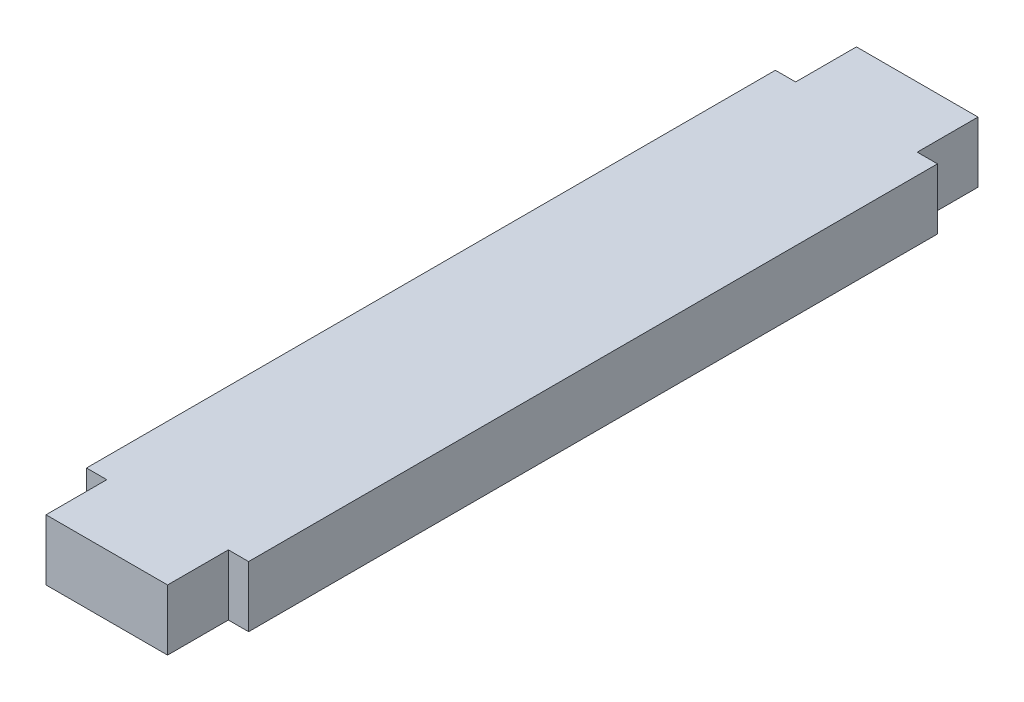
ISO-10303-21;
HEADER;
FILE_DESCRIPTION(('STEP AP214'),'2;1');
FILE_NAME('part.step','',(''),(''),'','','');
FILE_SCHEMA(('AUTOMOTIVE_DESIGN { 1 0 10303 214 1 1 1 1 }'));
ENDSEC;
DATA;
#1=APPLICATION_CONTEXT('core data for automotive mechanical design processes');
#2=APPLICATION_PROTOCOL_DEFINITION('international standard','automotive_design',2000,#1);
#3=PRODUCT_CONTEXT('',#1,'mechanical');
#4=PRODUCT('Part','Part','',(#3));
#5=PRODUCT_RELATED_PRODUCT_CATEGORY('part','',(#4));
#6=PRODUCT_DEFINITION_FORMATION('','',#4);
#7=PRODUCT_DEFINITION_CONTEXT('part definition',#1,'design');
#8=PRODUCT_DEFINITION('design','',#6,#7);
#9=PRODUCT_DEFINITION_SHAPE('','',#8);
#10=(LENGTH_UNIT() NAMED_UNIT(*) SI_UNIT(.MILLI.,.METRE.));
#11=(NAMED_UNIT(*) PLANE_ANGLE_UNIT() SI_UNIT($,.RADIAN.));
#12=(NAMED_UNIT(*) SI_UNIT($,.STERADIAN.) SOLID_ANGLE_UNIT());
#13=UNCERTAINTY_MEASURE_WITH_UNIT(LENGTH_MEASURE(1.E-05),#10,'distance_accuracy_value','');
#14=(GEOMETRIC_REPRESENTATION_CONTEXT(3) GLOBAL_UNCERTAINTY_ASSIGNED_CONTEXT((#13)) GLOBAL_UNIT_ASSIGNED_CONTEXT((#10,
#11,#12)) REPRESENTATION_CONTEXT('',''));
#15=CARTESIAN_POINT('',(0.,0.,0.));
#16=DIRECTION('',(0.,0.,1.));
#17=DIRECTION('',(1.,0.,0.));
#18=AXIS2_PLACEMENT_3D('',#15,#16,#17);
#19=CARTESIAN_POINT('',(0.,15.,0.));
#20=DIRECTION('',(1.,0.,0.));
#21=DIRECTION('',(0.,0.,-1.));
#22=AXIS2_PLACEMENT_3D('',#19,#20,#21);
#23=PLANE('',#22);
#24=DIRECTION('',(0.,0.,1.));
#25=VECTOR('',#24,1.);
#26=CARTESIAN_POINT('',(0.,0.,0.));
#27=LINE('',#26,#25);
#28=CARTESIAN_POINT('',(0.,0.,-15.));
#29=VERTEX_POINT('',#28);
#30=CARTESIAN_POINT('',(0.,0.,0.));
#31=VERTEX_POINT('',#30);
#32=EDGE_CURVE('E168',#29,#31,#27,.T.);
#33=ORIENTED_EDGE('',*,*,#32,.T.);
#34=DIRECTION('',(0.,-1.,0.));
#35=VECTOR('',#34,1.);
#36=CARTESIAN_POINT('',(0.,15.,0.));
#37=LINE('',#36,#35);
#38=CARTESIAN_POINT('',(0.,15.,0.));
#39=VERTEX_POINT('',#38);
#40=EDGE_CURVE('E11',#39,#31,#37,.T.);
#41=ORIENTED_EDGE('',*,*,#40,.F.);
#42=DIRECTION('',(0.,0.,1.));
#43=VECTOR('',#42,1.);
#44=CARTESIAN_POINT('',(0.,15.,0.));
#45=LINE('',#44,#43);
#46=CARTESIAN_POINT('',(0.,15.,-15.));
#47=VERTEX_POINT('',#46);
#48=EDGE_CURVE('E202',#47,#39,#45,.T.);
#49=ORIENTED_EDGE('',*,*,#48,.F.);
#50=DIRECTION('',(0.,-1.,0.));
#51=VECTOR('',#50,1.);
#52=CARTESIAN_POINT('',(0.,15.,-15.));
#53=LINE('',#52,#51);
#54=EDGE_CURVE('E164',#47,#29,#53,.T.);
#55=ORIENTED_EDGE('',*,*,#54,.T.);
#56=EDGE_LOOP('',(#33,#41,#49,#55));
#57=FACE_BOUND('',#56,.T.);
#58=ADVANCED_FACE('F43',(#57),#23,.F.);
#59=CARTESIAN_POINT('',(0.,15.,0.));
#60=DIRECTION('',(0.,0.,-1.));
#61=DIRECTION('',(-1.,0.,0.));
#62=AXIS2_PLACEMENT_3D('',#59,#60,#61);
#63=PLANE('',#62);
#64=DIRECTION('',(1.,0.,0.));
#65=VECTOR('',#64,1.);
#66=CARTESIAN_POINT('',(0.,0.,0.));
#67=LINE('',#66,#65);
#68=CARTESIAN_POINT('',(30.,0.,0.));
#69=VERTEX_POINT('',#68);
#70=EDGE_CURVE('E172',#31,#69,#67,.T.);
#71=ORIENTED_EDGE('',*,*,#70,.T.);
#72=DIRECTION('',(0.,-1.,0.));
#73=VECTOR('',#72,1.);
#74=CARTESIAN_POINT('',(30.,15.,0.));
#75=LINE('',#74,#73);
#76=CARTESIAN_POINT('',(30.,15.,0.));
#77=VERTEX_POINT('',#76);
#78=EDGE_CURVE('E52',#77,#69,#75,.T.);
#79=ORIENTED_EDGE('',*,*,#78,.F.);
#80=DIRECTION('',(1.,0.,0.));
#81=VECTOR('',#80,1.);
#82=CARTESIAN_POINT('',(0.,15.,0.));
#83=LINE('',#82,#81);
#84=EDGE_CURVE('E115',#39,#77,#83,.T.);
#85=ORIENTED_EDGE('',*,*,#84,.F.);
#86=ORIENTED_EDGE('',*,*,#40,.T.);
#87=EDGE_LOOP('',(#71,#79,#85,#86));
#88=FACE_BOUND('',#87,.T.);
#89=ADVANCED_FACE('F296',(#88),#63,.F.);
#90=CARTESIAN_POINT('',(30.,15.,0.));
#91=DIRECTION('',(-1.,0.,0.));
#92=DIRECTION('',(0.,0.,1.));
#93=AXIS2_PLACEMENT_3D('',#90,#91,#92);
#94=PLANE('',#93);
#95=DIRECTION('',(0.,0.,-1.));
#96=VECTOR('',#95,1.);
#97=CARTESIAN_POINT('',(30.,0.,0.));
#98=LINE('',#97,#96);
#99=CARTESIAN_POINT('',(30.,0.,-15.));
#100=VERTEX_POINT('',#99);
#101=EDGE_CURVE('E175',#69,#100,#98,.T.);
#102=ORIENTED_EDGE('',*,*,#101,.T.);
#103=DIRECTION('',(0.,-1.,0.));
#104=VECTOR('',#103,1.);
#105=CARTESIAN_POINT('',(30.,15.,-15.));
#106=LINE('',#105,#104);
#107=CARTESIAN_POINT('',(30.,15.,-15.));
#108=VERTEX_POINT('',#107);
#109=EDGE_CURVE('E229',#108,#100,#106,.T.);
#110=ORIENTED_EDGE('',*,*,#109,.F.);
#111=DIRECTION('',(0.,0.,-1.));
#112=VECTOR('',#111,1.);
#113=CARTESIAN_POINT('',(30.,15.,0.));
#114=LINE('',#113,#112);
#115=EDGE_CURVE('E239',#77,#108,#114,.T.);
#116=ORIENTED_EDGE('',*,*,#115,.F.);
#117=ORIENTED_EDGE('',*,*,#78,.T.);
#118=EDGE_LOOP('',(#102,#110,#116,#117));
#119=FACE_BOUND('',#118,.T.);
#120=ADVANCED_FACE('F237',(#119),#94,.F.);
#121=CARTESIAN_POINT('',(30.,15.,-15.));
#122=DIRECTION('',(0.,0.,-1.));
#123=DIRECTION('',(-1.,0.,0.));
#124=AXIS2_PLACEMENT_3D('',#121,#122,#123);
#125=PLANE('',#124);
#126=DIRECTION('',(1.,0.,0.));
#127=VECTOR('',#126,1.);
#128=CARTESIAN_POINT('',(30.,0.,-15.));
#129=LINE('',#128,#127);
#130=CARTESIAN_POINT('',(35.,0.,-15.));
#131=VERTEX_POINT('',#130);
#132=EDGE_CURVE('E178',#100,#131,#129,.T.);
#133=ORIENTED_EDGE('',*,*,#132,.T.);
#134=DIRECTION('',(0.,-1.,0.));
#135=VECTOR('',#134,1.);
#136=CARTESIAN_POINT('',(35.,15.,-15.));
#137=LINE('',#136,#135);
#138=CARTESIAN_POINT('',(35.,15.,-15.));
#139=VERTEX_POINT('',#138);
#140=EDGE_CURVE('E225',#139,#131,#137,.T.);
#141=ORIENTED_EDGE('',*,*,#140,.F.);
#142=DIRECTION('',(1.,0.,0.));
#143=VECTOR('',#142,1.);
#144=CARTESIAN_POINT('',(30.,15.,-15.));
#145=LINE('',#144,#143);
#146=EDGE_CURVE('E258',#108,#139,#145,.T.);
#147=ORIENTED_EDGE('',*,*,#146,.F.);
#148=ORIENTED_EDGE('',*,*,#109,.T.);
#149=EDGE_LOOP('',(#133,#141,#147,#148));
#150=FACE_BOUND('',#149,.T.);
#151=ADVANCED_FACE('F248',(#150),#125,.F.);
#152=CARTESIAN_POINT('',(35.,15.,-185.));
#153=DIRECTION('',(-1.,0.,0.));
#154=DIRECTION('',(0.,0.,1.));
#155=AXIS2_PLACEMENT_3D('',#152,#153,#154);
#156=PLANE('',#155);
#157=DIRECTION('',(0.,0.,-1.));
#158=VECTOR('',#157,1.);
#159=CARTESIAN_POINT('',(35.,0.,-185.));
#160=LINE('',#159,#158);
#161=CARTESIAN_POINT('',(35.,0.,-185.));
#162=VERTEX_POINT('',#161);
#163=EDGE_CURVE('E181',#131,#162,#160,.T.);
#164=ORIENTED_EDGE('',*,*,#163,.T.);
#165=DIRECTION('',(0.,-1.,0.));
#166=VECTOR('',#165,1.);
#167=CARTESIAN_POINT('',(35.,15.,-185.));
#168=LINE('',#167,#166);
#169=CARTESIAN_POINT('',(35.,15.,-185.));
#170=VERTEX_POINT('',#169);
#171=EDGE_CURVE('E221',#170,#162,#168,.T.);
#172=ORIENTED_EDGE('',*,*,#171,.F.);
#173=DIRECTION('',(0.,0.,-1.));
#174=VECTOR('',#173,1.);
#175=CARTESIAN_POINT('',(35.,15.,-185.));
#176=LINE('',#175,#174);
#177=EDGE_CURVE('E254',#139,#170,#176,.T.);
#178=ORIENTED_EDGE('',*,*,#177,.F.);
#179=ORIENTED_EDGE('',*,*,#140,.T.);
#180=EDGE_LOOP('',(#164,#172,#178,#179));
#181=FACE_BOUND('',#180,.T.);
#182=ADVANCED_FACE('F252',(#181),#156,.F.);
#183=CARTESIAN_POINT('',(30.,15.,-185.));
#184=DIRECTION('',(0.,0.,1.));
#185=DIRECTION('',(1.,0.,0.));
#186=AXIS2_PLACEMENT_3D('',#183,#184,#185);
#187=PLANE('',#186);
#188=DIRECTION('',(-1.,0.,0.));
#189=VECTOR('',#188,1.);
#190=CARTESIAN_POINT('',(30.,0.,-185.));
#191=LINE('',#190,#189);
#192=CARTESIAN_POINT('',(30.,0.,-185.));
#193=VERTEX_POINT('',#192);
#194=EDGE_CURVE('E184',#162,#193,#191,.T.);
#195=ORIENTED_EDGE('',*,*,#194,.T.);
#196=DIRECTION('',(0.,-1.,0.));
#197=VECTOR('',#196,1.);
#198=CARTESIAN_POINT('',(30.,15.,-185.));
#199=LINE('',#198,#197);
#200=CARTESIAN_POINT('',(30.,15.,-185.));
#201=VERTEX_POINT('',#200);
#202=EDGE_CURVE('E217',#201,#193,#199,.T.);
#203=ORIENTED_EDGE('',*,*,#202,.F.);
#204=DIRECTION('',(-1.,0.,0.));
#205=VECTOR('',#204,1.);
#206=CARTESIAN_POINT('',(30.,15.,-185.));
#207=LINE('',#206,#205);
#208=EDGE_CURVE('E257',#170,#201,#207,.T.);
#209=ORIENTED_EDGE('',*,*,#208,.F.);
#210=ORIENTED_EDGE('',*,*,#171,.T.);
#211=EDGE_LOOP('',(#195,#203,#209,#210));
#212=FACE_BOUND('',#211,.T.);
#213=ADVANCED_FACE('F309',(#212),#187,.F.);
#214=CARTESIAN_POINT('',(30.,15.,-185.));
#215=DIRECTION('',(-1.,0.,0.));
#216=DIRECTION('',(0.,0.,1.));
#217=AXIS2_PLACEMENT_3D('',#214,#215,#216);
#218=PLANE('',#217);
#219=DIRECTION('',(0.,0.,-1.));
#220=VECTOR('',#219,1.);
#221=CARTESIAN_POINT('',(30.,0.,-185.));
#222=LINE('',#221,#220);
#223=CARTESIAN_POINT('',(30.,0.,-200.));
#224=VERTEX_POINT('',#223);
#225=EDGE_CURVE('E187',#193,#224,#222,.T.);
#226=ORIENTED_EDGE('',*,*,#225,.T.);
#227=DIRECTION('',(0.,-1.,0.));
#228=VECTOR('',#227,1.);
#229=CARTESIAN_POINT('',(30.,15.,-200.));
#230=LINE('',#229,#228);
#231=CARTESIAN_POINT('',(30.,15.,-200.));
#232=VERTEX_POINT('',#231);
#233=EDGE_CURVE('E213',#232,#224,#230,.T.);
#234=ORIENTED_EDGE('',*,*,#233,.F.);
#235=DIRECTION('',(0.,0.,-1.));
#236=VECTOR('',#235,1.);
#237=CARTESIAN_POINT('',(30.,15.,-185.));
#238=LINE('',#237,#236);
#239=EDGE_CURVE('E262',#201,#232,#238,.T.);
#240=ORIENTED_EDGE('',*,*,#239,.F.);
#241=ORIENTED_EDGE('',*,*,#202,.T.);
#242=EDGE_LOOP('',(#226,#234,#240,#241));
#243=FACE_BOUND('',#242,.T.);
#244=ADVANCED_FACE('F312',(#243),#218,.F.);
#245=CARTESIAN_POINT('',(0.,15.,-200.));
#246=DIRECTION('',(0.,0.,1.));
#247=DIRECTION('',(1.,0.,0.));
#248=AXIS2_PLACEMENT_3D('',#245,#246,#247);
#249=PLANE('',#248);
#250=DIRECTION('',(-1.,0.,0.));
#251=VECTOR('',#250,1.);
#252=CARTESIAN_POINT('',(0.,0.,-200.));
#253=LINE('',#252,#251);
#254=CARTESIAN_POINT('',(0.,0.,-200.));
#255=VERTEX_POINT('',#254);
#256=EDGE_CURVE('E190',#224,#255,#253,.T.);
#257=ORIENTED_EDGE('',*,*,#256,.T.);
#258=DIRECTION('',(0.,-1.,0.));
#259=VECTOR('',#258,1.);
#260=CARTESIAN_POINT('',(0.,15.,-200.));
#261=LINE('',#260,#259);
#262=CARTESIAN_POINT('',(0.,15.,-200.));
#263=VERTEX_POINT('',#262);
#264=EDGE_CURVE('E209',#263,#255,#261,.T.);
#265=ORIENTED_EDGE('',*,*,#264,.F.);
#266=DIRECTION('',(-1.,0.,0.));
#267=VECTOR('',#266,1.);
#268=CARTESIAN_POINT('',(0.,15.,-200.));
#269=LINE('',#268,#267);
#270=EDGE_CURVE('E269',#232,#263,#269,.T.);
#271=ORIENTED_EDGE('',*,*,#270,.F.);
#272=ORIENTED_EDGE('',*,*,#233,.T.);
#273=EDGE_LOOP('',(#257,#265,#271,#272));
#274=FACE_BOUND('',#273,.T.);
#275=ADVANCED_FACE('F277',(#274),#249,.F.);
#276=CARTESIAN_POINT('',(0.,15.,-185.));
#277=DIRECTION('',(1.,0.,0.));
#278=DIRECTION('',(0.,0.,-1.));
#279=AXIS2_PLACEMENT_3D('',#276,#277,#278);
#280=PLANE('',#279);
#281=DIRECTION('',(0.,0.,1.));
#282=VECTOR('',#281,1.);
#283=CARTESIAN_POINT('',(0.,0.,-185.));
#284=LINE('',#283,#282);
#285=CARTESIAN_POINT('',(0.,0.,-185.));
#286=VERTEX_POINT('',#285);
#287=EDGE_CURVE('E193',#255,#286,#284,.T.);
#288=ORIENTED_EDGE('',*,*,#287,.T.);
#289=DIRECTION('',(0.,-1.,0.));
#290=VECTOR('',#289,1.);
#291=CARTESIAN_POINT('',(0.,15.,-185.));
#292=LINE('',#291,#290);
#293=CARTESIAN_POINT('',(0.,15.,-185.));
#294=VERTEX_POINT('',#293);
#295=EDGE_CURVE('E157',#294,#286,#292,.T.);
#296=ORIENTED_EDGE('',*,*,#295,.F.);
#297=DIRECTION('',(0.,0.,1.));
#298=VECTOR('',#297,1.);
#299=CARTESIAN_POINT('',(0.,15.,-185.));
#300=LINE('',#299,#298);
#301=EDGE_CURVE('E146',#263,#294,#300,.T.);
#302=ORIENTED_EDGE('',*,*,#301,.F.);
#303=ORIENTED_EDGE('',*,*,#264,.T.);
#304=EDGE_LOOP('',(#288,#296,#302,#303));
#305=FACE_BOUND('',#304,.T.);
#306=ADVANCED_FACE('F281',(#305),#280,.F.);
#307=CARTESIAN_POINT('',(-5.,15.,-185.));
#308=DIRECTION('',(0.,0.,1.));
#309=DIRECTION('',(1.,0.,0.));
#310=AXIS2_PLACEMENT_3D('',#307,#308,#309);
#311=PLANE('',#310);
#312=DIRECTION('',(-1.,0.,0.));
#313=VECTOR('',#312,1.);
#314=CARTESIAN_POINT('',(-5.,0.,-185.));
#315=LINE('',#314,#313);
#316=CARTESIAN_POINT('',(-5.,0.,-185.));
#317=VERTEX_POINT('',#316);
#318=EDGE_CURVE('E155',#286,#317,#315,.T.);
#319=ORIENTED_EDGE('',*,*,#318,.T.);
#320=DIRECTION('',(0.,-1.,0.));
#321=VECTOR('',#320,1.);
#322=CARTESIAN_POINT('',(-5.,15.,-185.));
#323=LINE('',#322,#321);
#324=CARTESIAN_POINT('',(-5.,15.,-185.));
#325=VERTEX_POINT('',#324);
#326=EDGE_CURVE('E152',#325,#317,#323,.T.);
#327=ORIENTED_EDGE('',*,*,#326,.F.);
#328=DIRECTION('',(-1.,0.,0.));
#329=VECTOR('',#328,1.);
#330=CARTESIAN_POINT('',(-5.,15.,-185.));
#331=LINE('',#330,#329);
#332=EDGE_CURVE('E140',#294,#325,#331,.T.);
#333=ORIENTED_EDGE('',*,*,#332,.F.);
#334=ORIENTED_EDGE('',*,*,#295,.T.);
#335=EDGE_LOOP('',(#319,#327,#333,#334));
#336=FACE_BOUND('',#335,.T.);
#337=ADVANCED_FACE('F153',(#336),#311,.F.);
#338=CARTESIAN_POINT('',(-5.,15.,-185.));
#339=DIRECTION('',(1.,0.,0.));
#340=DIRECTION('',(0.,0.,-1.));
#341=AXIS2_PLACEMENT_3D('',#338,#339,#340);
#342=PLANE('',#341);
#343=DIRECTION('',(0.,0.,1.));
#344=VECTOR('',#343,1.);
#345=CARTESIAN_POINT('',(-5.,0.,-185.));
#346=LINE('',#345,#344);
#347=CARTESIAN_POINT('',(-5.,0.,-15.));
#348=VERTEX_POINT('',#347);
#349=EDGE_CURVE('E101',#317,#348,#346,.T.);
#350=ORIENTED_EDGE('',*,*,#349,.T.);
#351=DIRECTION('',(0.,-1.,0.));
#352=VECTOR('',#351,1.);
#353=CARTESIAN_POINT('',(-5.,15.,-15.));
#354=LINE('',#353,#352);
#355=CARTESIAN_POINT('',(-5.,15.,-15.));
#356=VERTEX_POINT('',#355);
#357=EDGE_CURVE('E158',#356,#348,#354,.T.);
#358=ORIENTED_EDGE('',*,*,#357,.F.);
#359=DIRECTION('',(0.,0.,1.));
#360=VECTOR('',#359,1.);
#361=CARTESIAN_POINT('',(-5.,15.,-185.));
#362=LINE('',#361,#360);
#363=EDGE_CURVE('E144',#325,#356,#362,.T.);
#364=ORIENTED_EDGE('',*,*,#363,.F.);
#365=ORIENTED_EDGE('',*,*,#326,.T.);
#366=EDGE_LOOP('',(#350,#358,#364,#365));
#367=FACE_BOUND('',#366,.T.);
#368=ADVANCED_FACE('F160',(#367),#342,.F.);
#369=CARTESIAN_POINT('',(-5.,15.,-15.));
#370=DIRECTION('',(0.,0.,-1.));
#371=DIRECTION('',(-1.,0.,0.));
#372=AXIS2_PLACEMENT_3D('',#369,#370,#371);
#373=PLANE('',#372);
#374=DIRECTION('',(1.,0.,0.));
#375=VECTOR('',#374,1.);
#376=CARTESIAN_POINT('',(-5.,0.,-15.));
#377=LINE('',#376,#375);
#378=EDGE_CURVE('E107',#348,#29,#377,.T.);
#379=ORIENTED_EDGE('',*,*,#378,.T.);
#380=ORIENTED_EDGE('',*,*,#54,.F.);
#381=DIRECTION('',(1.,0.,0.));
#382=VECTOR('',#381,1.);
#383=CARTESIAN_POINT('',(-5.,15.,-15.));
#384=LINE('',#383,#382);
#385=EDGE_CURVE('E60',#356,#47,#384,.T.);
#386=ORIENTED_EDGE('',*,*,#385,.F.);
#387=ORIENTED_EDGE('',*,*,#357,.T.);
#388=EDGE_LOOP('',(#379,#380,#386,#387));
#389=FACE_BOUND('',#388,.T.);
#390=ADVANCED_FACE('F285',(#389),#373,.F.);
#391=CARTESIAN_POINT('',(0.,15.,0.));
#392=DIRECTION('',(0.,-1.,0.));
#393=DIRECTION('',(0.,0.,-1.));
#394=AXIS2_PLACEMENT_3D('',#391,#392,#393);
#395=PLANE('',#394);
#396=ORIENTED_EDGE('',*,*,#48,.T.);
#397=ORIENTED_EDGE('',*,*,#84,.T.);
#398=ORIENTED_EDGE('',*,*,#115,.T.);
#399=ORIENTED_EDGE('',*,*,#146,.T.);
#400=ORIENTED_EDGE('',*,*,#177,.T.);
#401=ORIENTED_EDGE('',*,*,#208,.T.);
#402=ORIENTED_EDGE('',*,*,#239,.T.);
#403=ORIENTED_EDGE('',*,*,#270,.T.);
#404=ORIENTED_EDGE('',*,*,#301,.T.);
#405=ORIENTED_EDGE('',*,*,#332,.T.);
#406=ORIENTED_EDGE('',*,*,#363,.T.);
#407=ORIENTED_EDGE('',*,*,#385,.T.);
#408=EDGE_LOOP('',(#396,#397,#398,#399,#400,#401,#402,#403,#404,#405,#406,#407));
#409=FACE_BOUND('',#408,.T.);
#410=ADVANCED_FACE('F142',(#409),#395,.F.);
#411=CARTESIAN_POINT('',(0.,0.,0.));
#412=DIRECTION('',(0.,-1.,0.));
#413=DIRECTION('',(0.,0.,-1.));
#414=AXIS2_PLACEMENT_3D('',#411,#412,#413);
#415=PLANE('',#414);
#416=ORIENTED_EDGE('',*,*,#32,.F.);
#417=ORIENTED_EDGE('',*,*,#378,.F.);
#418=ORIENTED_EDGE('',*,*,#349,.F.);
#419=ORIENTED_EDGE('',*,*,#318,.F.);
#420=ORIENTED_EDGE('',*,*,#287,.F.);
#421=ORIENTED_EDGE('',*,*,#256,.F.);
#422=ORIENTED_EDGE('',*,*,#225,.F.);
#423=ORIENTED_EDGE('',*,*,#194,.F.);
#424=ORIENTED_EDGE('',*,*,#163,.F.);
#425=ORIENTED_EDGE('',*,*,#132,.F.);
#426=ORIENTED_EDGE('',*,*,#101,.F.);
#427=ORIENTED_EDGE('',*,*,#70,.F.);
#428=EDGE_LOOP('',(#416,#417,#418,#419,#420,#421,#422,#423,#424,#425,#426,#427));
#429=FACE_BOUND('',#428,.T.);
#430=ADVANCED_FACE('F243',(#429),#415,.T.);
#431=CLOSED_SHELL('',(#58,#89,#120,#151,#182,#213,#244,#275,#306,#337,#368,#390,#410,#430));
#432=MANIFOLD_SOLID_BREP('B2',#431);
#433=ADVANCED_BREP_SHAPE_REPRESENTATION('',(#18,#432),#14);
#434=SHAPE_DEFINITION_REPRESENTATION(#9,#433);
ENDSEC;
END-ISO-10303-21;
